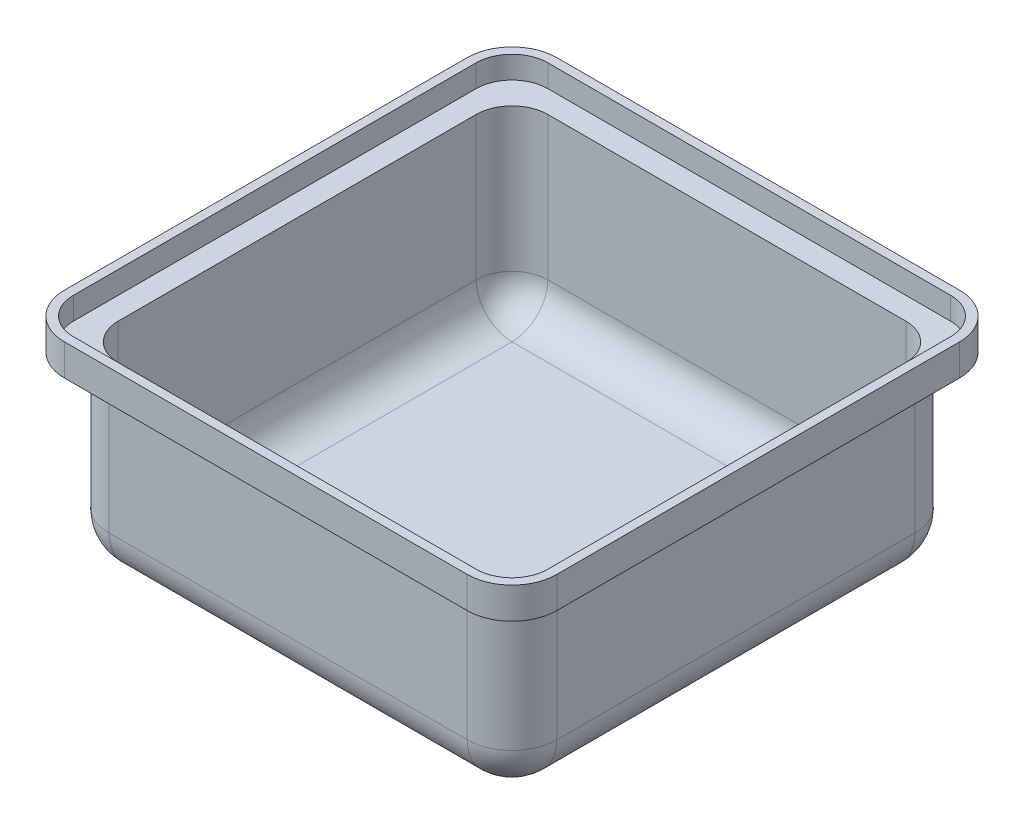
from build123d import *

# Parameters (mm, degrees)
SKETCH1_W      = 127
SKETCH1_H      = 127
EXTRUDE1_DEPTH = 50.8
SKETCH2_W      = 139.7
SKETCH2_H      = 139.7
EXTRUDE2_DEPTH = 8.89
FILLET1_R      = 12.7
SHELL1_T       = -2.54


with BuildPart() as part:
    # Sketch1 → Extrude1 (new body)
    with BuildSketch(Plane(origin=(0, 0, 0), x_dir=(1, 0, 0), z_dir=(0, 1, 0))):
        Rectangle(SKETCH1_W, SKETCH1_H)
    extrude(amount=EXTRUDE1_DEPTH)

    # Sketch2 → Extrude2 (add)
    with BuildSketch(Plane(origin=(0, 50.8, 0), x_dir=(-1, 0, 0), z_dir=(0, 1, 0))):
        Rectangle(SKETCH2_W, SKETCH2_H)
    extrude(amount=EXTRUDE2_DEPTH)

    # Fillet1
    fillet1_edges = [part.edges().sort_by_distance(p)[0] for p in [
        (69.85, 55.245, 69.85),
        (69.85, 55.245, -69.85),
        (-69.85, 55.245, -69.85),
        (-69.85, 55.245, 69.85),
        (0, 0, -63.5),
        (63.5, 0, 0),
        (0, 0, 63.5),
        (-63.5, 0, 0),
        (-63.5, 25.4, -63.5),
        (63.5, 25.4, -63.5),
        (63.5, 25.4, 63.5),
        (-63.5, 25.4, 63.5),
    ]]
    fillet(fillet1_edges, radius=FILLET1_R)

    # Shell1
    shell1_openings = [part.faces().sort_by_distance(p)[0] for p in [
        (0, 59.69, 0),
    ]]
    offset(amount=SHELL1_T, openings=shell1_openings, kind=Kind.INTERSECTION)


solid = part.part
